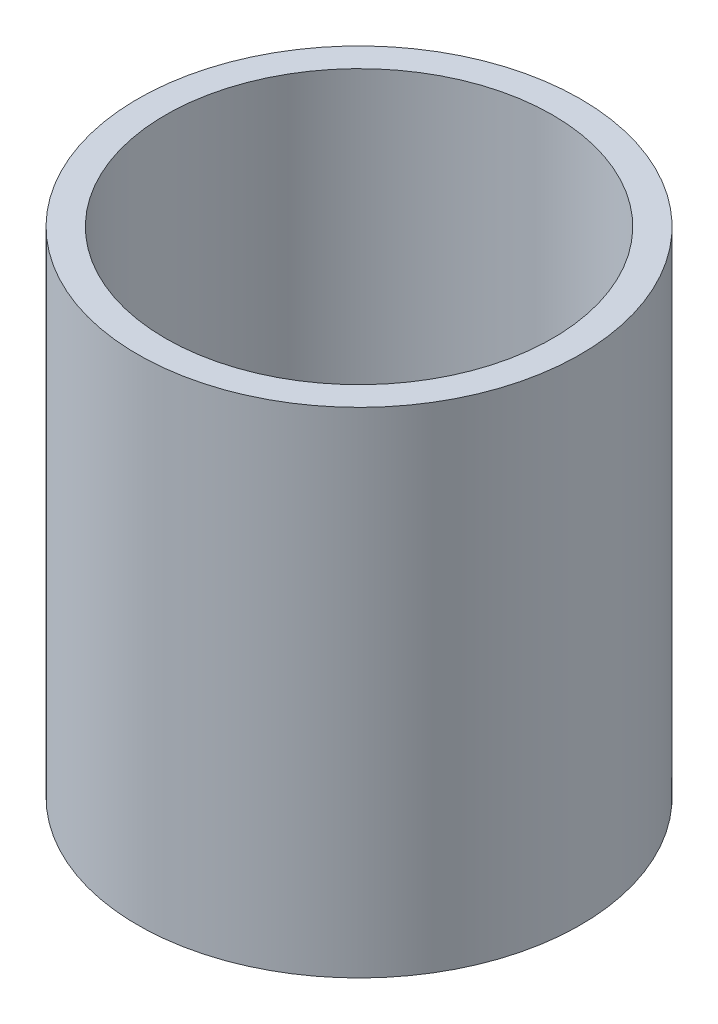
ISO-10303-21;
HEADER;
FILE_DESCRIPTION(('STEP AP214'),'2;1');
FILE_NAME('part.step','',(''),(''),'','','');
FILE_SCHEMA(('AUTOMOTIVE_DESIGN { 1 0 10303 214 1 1 1 1 }'));
ENDSEC;
DATA;
#1=APPLICATION_CONTEXT('core data for automotive mechanical design processes');
#2=APPLICATION_PROTOCOL_DEFINITION('international standard','automotive_design',2000,#1);
#3=PRODUCT_CONTEXT('',#1,'mechanical');
#4=PRODUCT('Part','Part','',(#3));
#5=PRODUCT_RELATED_PRODUCT_CATEGORY('part','',(#4));
#6=PRODUCT_DEFINITION_FORMATION('','',#4);
#7=PRODUCT_DEFINITION_CONTEXT('part definition',#1,'design');
#8=PRODUCT_DEFINITION('design','',#6,#7);
#9=PRODUCT_DEFINITION_SHAPE('','',#8);
#10=(LENGTH_UNIT() NAMED_UNIT(*) SI_UNIT(.MILLI.,.METRE.));
#11=(NAMED_UNIT(*) PLANE_ANGLE_UNIT() SI_UNIT($,.RADIAN.));
#12=(NAMED_UNIT(*) SI_UNIT($,.STERADIAN.) SOLID_ANGLE_UNIT());
#13=UNCERTAINTY_MEASURE_WITH_UNIT(LENGTH_MEASURE(1.E-05),#10,'distance_accuracy_value','');
#14=(GEOMETRIC_REPRESENTATION_CONTEXT(3) GLOBAL_UNCERTAINTY_ASSIGNED_CONTEXT((#13)) GLOBAL_UNIT_ASSIGNED_CONTEXT((#10,
#11,#12)) REPRESENTATION_CONTEXT('',''));
#15=CARTESIAN_POINT('',(0.,0.,0.));
#16=DIRECTION('',(0.,0.,1.));
#17=DIRECTION('',(1.,0.,0.));
#18=AXIS2_PLACEMENT_3D('',#15,#16,#17);
#19=CARTESIAN_POINT('',(0.,304.8,0.));
#20=DIRECTION('',(0.,1.,0.));
#21=DIRECTION('',(0.,0.,1.));
#22=AXIS2_PLACEMENT_3D('',#19,#20,#21);
#23=PLANE('',#22);
#24=CARTESIAN_POINT('',(0.,304.8,0.));
#25=DIRECTION('',(0.,1.,0.));
#26=DIRECTION('',(0.,0.,1.));
#27=AXIS2_PLACEMENT_3D('',#24,#25,#26);
#28=CIRCLE('',#27,136.525);
#29=CARTESIAN_POINT('',(0.,304.8,-136.525));
#30=VERTEX_POINT('',#29);
#31=EDGE_CURVE('E10',#30,#30,#28,.T.);
#32=ORIENTED_EDGE('',*,*,#31,.T.);
#33=EDGE_LOOP('',(#32));
#34=FACE_BOUND('',#33,.T.);
#35=CARTESIAN_POINT('',(0.,304.8,0.));
#36=DIRECTION('',(0.,1.,0.));
#37=DIRECTION('',(0.,0.,1.));
#38=AXIS2_PLACEMENT_3D('',#35,#36,#37);
#39=CIRCLE('',#38,119.38);
#40=CARTESIAN_POINT('',(0.,304.8,-119.38));
#41=VERTEX_POINT('',#40);
#42=EDGE_CURVE('E42',#41,#41,#39,.T.);
#43=ORIENTED_EDGE('',*,*,#42,.F.);
#44=EDGE_LOOP('',(#43));
#45=FACE_BOUND('',#44,.T.);
#46=ADVANCED_FACE('F31',(#34,#45),#23,.T.);
#47=CARTESIAN_POINT('',(0.,0.,0.));
#48=DIRECTION('',(0.,1.,0.));
#49=DIRECTION('',(0.,0.,1.));
#50=AXIS2_PLACEMENT_3D('',#47,#48,#49);
#51=PLANE('',#50);
#52=CARTESIAN_POINT('',(0.,0.,0.));
#53=DIRECTION('',(0.,1.,0.));
#54=DIRECTION('',(0.,0.,1.));
#55=AXIS2_PLACEMENT_3D('',#52,#53,#54);
#56=CIRCLE('',#55,136.525);
#57=CARTESIAN_POINT('',(0.,0.,-136.525));
#58=VERTEX_POINT('',#57);
#59=EDGE_CURVE('E35',#58,#58,#56,.T.);
#60=ORIENTED_EDGE('',*,*,#59,.F.);
#61=EDGE_LOOP('',(#60));
#62=FACE_BOUND('',#61,.T.);
#63=CARTESIAN_POINT('',(0.,0.,0.));
#64=DIRECTION('',(0.,1.,0.));
#65=DIRECTION('',(0.,0.,1.));
#66=AXIS2_PLACEMENT_3D('',#63,#64,#65);
#67=CIRCLE('',#66,119.38);
#68=CARTESIAN_POINT('',(0.,0.,-119.38));
#69=VERTEX_POINT('',#68);
#70=EDGE_CURVE('E44',#69,#69,#67,.T.);
#71=ORIENTED_EDGE('',*,*,#70,.T.);
#72=EDGE_LOOP('',(#71));
#73=FACE_BOUND('',#72,.T.);
#74=ADVANCED_FACE('F54',(#62,#73),#51,.F.);
#75=CARTESIAN_POINT('',(0.,304.8,0.));
#76=DIRECTION('',(0.,-1.,0.));
#77=DIRECTION('',(0.,0.,-1.));
#78=AXIS2_PLACEMENT_3D('',#75,#76,#77);
#79=CYLINDRICAL_SURFACE('',#78,136.525);
#80=CARTESIAN_POINT('',(0.,304.8,-136.525));
#81=CARTESIAN_POINT('',(0.,301.625,-136.525));
#82=CARTESIAN_POINT('',(0.,298.45,-136.525));
#83=CARTESIAN_POINT('',(0.,292.1,-136.525));
#84=CARTESIAN_POINT('',(0.,288.925,-136.525));
#85=CARTESIAN_POINT('',(0.,282.575,-136.525));
#86=CARTESIAN_POINT('',(0.,279.4,-136.525));
#87=CARTESIAN_POINT('',(0.,273.05,-136.525));
#88=CARTESIAN_POINT('',(0.,269.875,-136.525));
#89=CARTESIAN_POINT('',(0.,263.525,-136.525));
#90=CARTESIAN_POINT('',(0.,260.35,-136.525));
#91=CARTESIAN_POINT('',(0.,254.,-136.525));
#92=CARTESIAN_POINT('',(0.,250.825,-136.525));
#93=CARTESIAN_POINT('',(0.,244.475,-136.525));
#94=CARTESIAN_POINT('',(0.,241.3,-136.525));
#95=CARTESIAN_POINT('',(0.,234.95,-136.525));
#96=CARTESIAN_POINT('',(0.,231.775,-136.525));
#97=CARTESIAN_POINT('',(0.,225.425,-136.525));
#98=CARTESIAN_POINT('',(0.,222.25,-136.525));
#99=CARTESIAN_POINT('',(0.,215.9,-136.525));
#100=CARTESIAN_POINT('',(0.,212.725,-136.525));
#101=CARTESIAN_POINT('',(0.,206.375,-136.525));
#102=CARTESIAN_POINT('',(0.,203.2,-136.525));
#103=CARTESIAN_POINT('',(0.,196.85,-136.525));
#104=CARTESIAN_POINT('',(0.,193.675,-136.525));
#105=CARTESIAN_POINT('',(0.,187.325,-136.525));
#106=CARTESIAN_POINT('',(0.,184.15,-136.525));
#107=CARTESIAN_POINT('',(0.,177.8,-136.525));
#108=CARTESIAN_POINT('',(0.,174.625,-136.525));
#109=CARTESIAN_POINT('',(0.,168.275,-136.525));
#110=CARTESIAN_POINT('',(0.,165.1,-136.525));
#111=CARTESIAN_POINT('',(0.,158.75,-136.525));
#112=CARTESIAN_POINT('',(0.,155.575,-136.525));
#113=CARTESIAN_POINT('',(0.,149.225,-136.525));
#114=CARTESIAN_POINT('',(0.,146.05,-136.525));
#115=CARTESIAN_POINT('',(0.,139.7,-136.525));
#116=CARTESIAN_POINT('',(0.,136.525,-136.525));
#117=CARTESIAN_POINT('',(0.,130.175,-136.525));
#118=CARTESIAN_POINT('',(0.,127.,-136.525));
#119=CARTESIAN_POINT('',(0.,120.65,-136.525));
#120=CARTESIAN_POINT('',(0.,117.475,-136.525));
#121=CARTESIAN_POINT('',(0.,111.125,-136.525));
#122=CARTESIAN_POINT('',(0.,107.95,-136.525));
#123=CARTESIAN_POINT('',(0.,101.6,-136.525));
#124=CARTESIAN_POINT('',(0.,98.425,-136.525));
#125=CARTESIAN_POINT('',(0.,92.075,-136.525));
#126=CARTESIAN_POINT('',(0.,88.9,-136.525));
#127=CARTESIAN_POINT('',(0.,82.55,-136.525));
#128=CARTESIAN_POINT('',(0.,79.375,-136.525));
#129=CARTESIAN_POINT('',(0.,73.025,-136.525));
#130=CARTESIAN_POINT('',(0.,69.85,-136.525));
#131=CARTESIAN_POINT('',(0.,63.5,-136.525));
#132=CARTESIAN_POINT('',(0.,60.325,-136.525));
#133=CARTESIAN_POINT('',(0.,53.975,-136.525));
#134=CARTESIAN_POINT('',(0.,50.8,-136.525));
#135=CARTESIAN_POINT('',(0.,44.45,-136.525));
#136=CARTESIAN_POINT('',(0.,41.275,-136.525));
#137=CARTESIAN_POINT('',(0.,34.925,-136.525));
#138=CARTESIAN_POINT('',(0.,31.75,-136.525));
#139=CARTESIAN_POINT('',(0.,25.4,-136.525));
#140=CARTESIAN_POINT('',(0.,22.225,-136.525));
#141=CARTESIAN_POINT('',(0.,15.875,-136.525));
#142=CARTESIAN_POINT('',(0.,12.7,-136.525));
#143=CARTESIAN_POINT('',(0.,6.35,-136.525));
#144=CARTESIAN_POINT('',(0.,3.175,-136.525));
#145=CARTESIAN_POINT('',(0.,0.,-136.525));
#146=B_SPLINE_CURVE_WITH_KNOTS('',3,(#80,#81,#82,#83,#84,#85,#86,#87,#88,#89,#90,#91,#92,#93,
#94,#95,#96,#97,#98,#99,#100,#101,#102,#103,#104,#105,#106,#107,#108,#109,#110,#111,#112,#113,
#114,#115,#116,#117,#118,#119,#120,#121,#122,#123,#124,#125,#126,#127,#128,#129,#130,#131,#132,
#133,#134,#135,#136,#137,#138,#139,#140,#141,#142,#143,#144,#145),.UNSPECIFIED.,.F.,.F.,(4,2,2,
2,2,2,2,2,2,2,2,2,2,2,2,2,2,2,2,2,2,2,2,2,2,2,2,2,2,2,2,2,4),(0.,9.52499999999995,19.05,28.575,
38.1,47.625,57.15,66.675,76.2,85.725,95.2499999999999,104.775,114.3,123.825,133.35,142.875,
152.4,161.925,171.45,180.975,190.5,200.025,209.55,219.075,228.6,238.125,247.65,257.175,266.7,
276.225,285.75,295.275,304.8),.UNSPECIFIED.);
#147=EDGE_CURVE('BSEAM33',#30,#58,#146,.T.);
#148=ORIENTED_EDGE('',*,*,#31,.F.);
#149=ORIENTED_EDGE('',*,*,#59,.T.);
#150=ORIENTED_EDGE('',*,*,#147,.T.);
#151=ORIENTED_EDGE('',*,*,#147,.F.);
#152=EDGE_LOOP('',(#148,#150,#149,#151));
#153=FACE_BOUND('',#152,.T.);
#154=ADVANCED_FACE('F33',(#153),#79,.T.);
#155=CARTESIAN_POINT('',(0.,304.8,0.));
#156=DIRECTION('',(0.,-1.,0.));
#157=DIRECTION('',(0.,0.,-1.));
#158=AXIS2_PLACEMENT_3D('',#155,#156,#157);
#159=CYLINDRICAL_SURFACE('',#158,119.38);
#160=CARTESIAN_POINT('',(0.,304.8,-119.38));
#161=CARTESIAN_POINT('',(0.,301.625,-119.38));
#162=CARTESIAN_POINT('',(0.,298.45,-119.38));
#163=CARTESIAN_POINT('',(0.,292.1,-119.38));
#164=CARTESIAN_POINT('',(0.,288.925,-119.38));
#165=CARTESIAN_POINT('',(0.,282.575,-119.38));
#166=CARTESIAN_POINT('',(0.,279.4,-119.38));
#167=CARTESIAN_POINT('',(0.,273.05,-119.38));
#168=CARTESIAN_POINT('',(0.,269.875,-119.38));
#169=CARTESIAN_POINT('',(0.,263.525,-119.38));
#170=CARTESIAN_POINT('',(0.,260.35,-119.38));
#171=CARTESIAN_POINT('',(0.,254.,-119.38));
#172=CARTESIAN_POINT('',(0.,250.825,-119.38));
#173=CARTESIAN_POINT('',(0.,244.475,-119.38));
#174=CARTESIAN_POINT('',(0.,241.3,-119.38));
#175=CARTESIAN_POINT('',(0.,234.95,-119.38));
#176=CARTESIAN_POINT('',(0.,231.775,-119.38));
#177=CARTESIAN_POINT('',(0.,225.425,-119.38));
#178=CARTESIAN_POINT('',(0.,222.25,-119.38));
#179=CARTESIAN_POINT('',(0.,215.9,-119.38));
#180=CARTESIAN_POINT('',(0.,212.725,-119.38));
#181=CARTESIAN_POINT('',(0.,206.375,-119.38));
#182=CARTESIAN_POINT('',(0.,203.2,-119.38));
#183=CARTESIAN_POINT('',(0.,196.85,-119.38));
#184=CARTESIAN_POINT('',(0.,193.675,-119.38));
#185=CARTESIAN_POINT('',(0.,187.325,-119.38));
#186=CARTESIAN_POINT('',(0.,184.15,-119.38));
#187=CARTESIAN_POINT('',(0.,177.8,-119.38));
#188=CARTESIAN_POINT('',(0.,174.625,-119.38));
#189=CARTESIAN_POINT('',(0.,168.275,-119.38));
#190=CARTESIAN_POINT('',(0.,165.1,-119.38));
#191=CARTESIAN_POINT('',(0.,158.75,-119.38));
#192=CARTESIAN_POINT('',(0.,155.575,-119.38));
#193=CARTESIAN_POINT('',(0.,149.225,-119.38));
#194=CARTESIAN_POINT('',(0.,146.05,-119.38));
#195=CARTESIAN_POINT('',(0.,139.7,-119.38));
#196=CARTESIAN_POINT('',(0.,136.525,-119.38));
#197=CARTESIAN_POINT('',(0.,130.175,-119.38));
#198=CARTESIAN_POINT('',(0.,127.,-119.38));
#199=CARTESIAN_POINT('',(0.,120.65,-119.38));
#200=CARTESIAN_POINT('',(0.,117.475,-119.38));
#201=CARTESIAN_POINT('',(0.,111.125,-119.38));
#202=CARTESIAN_POINT('',(0.,107.95,-119.38));
#203=CARTESIAN_POINT('',(0.,101.6,-119.38));
#204=CARTESIAN_POINT('',(0.,98.425,-119.38));
#205=CARTESIAN_POINT('',(0.,92.075,-119.38));
#206=CARTESIAN_POINT('',(0.,88.9,-119.38));
#207=CARTESIAN_POINT('',(0.,82.55,-119.38));
#208=CARTESIAN_POINT('',(0.,79.375,-119.38));
#209=CARTESIAN_POINT('',(0.,73.025,-119.38));
#210=CARTESIAN_POINT('',(0.,69.85,-119.38));
#211=CARTESIAN_POINT('',(0.,63.5,-119.38));
#212=CARTESIAN_POINT('',(0.,60.325,-119.38));
#213=CARTESIAN_POINT('',(0.,53.975,-119.38));
#214=CARTESIAN_POINT('',(0.,50.8,-119.38));
#215=CARTESIAN_POINT('',(0.,44.45,-119.38));
#216=CARTESIAN_POINT('',(0.,41.275,-119.38));
#217=CARTESIAN_POINT('',(0.,34.925,-119.38));
#218=CARTESIAN_POINT('',(0.,31.75,-119.38));
#219=CARTESIAN_POINT('',(0.,25.4,-119.38));
#220=CARTESIAN_POINT('',(0.,22.225,-119.38));
#221=CARTESIAN_POINT('',(0.,15.875,-119.38));
#222=CARTESIAN_POINT('',(0.,12.7,-119.38));
#223=CARTESIAN_POINT('',(0.,6.35,-119.38));
#224=CARTESIAN_POINT('',(0.,3.175,-119.38));
#225=CARTESIAN_POINT('',(0.,0.,-119.38));
#226=B_SPLINE_CURVE_WITH_KNOTS('',3,(#160,#161,#162,#163,#164,#165,#166,#167,#168,#169,#170,
#171,#172,#173,#174,#175,#176,#177,#178,#179,#180,#181,#182,#183,#184,#185,#186,#187,#188,#189,
#190,#191,#192,#193,#194,#195,#196,#197,#198,#199,#200,#201,#202,#203,#204,#205,#206,#207,#208,
#209,#210,#211,#212,#213,#214,#215,#216,#217,#218,#219,#220,#221,#222,#223,#224,#225),
.UNSPECIFIED.,.F.,.F.,(4,2,2,2,2,2,2,2,2,2,2,2,2,2,2,2,2,2,2,2,2,2,2,2,2,2,2,2,2,2,2,2,4),(0.,
9.52499999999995,19.05,28.575,38.1,47.625,57.15,66.675,76.2,85.725,95.2499999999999,104.775,
114.3,123.825,133.35,142.875,152.4,161.925,171.45,180.975,190.5,200.025,209.55,219.075,228.6,
238.125,247.65,257.175,266.7,276.225,285.75,295.275,304.8),.UNSPECIFIED.);
#227=EDGE_CURVE('BSEAM50',#41,#69,#226,.T.);
#228=ORIENTED_EDGE('',*,*,#42,.T.);
#229=ORIENTED_EDGE('',*,*,#70,.F.);
#230=ORIENTED_EDGE('',*,*,#227,.T.);
#231=ORIENTED_EDGE('',*,*,#227,.F.);
#232=EDGE_LOOP('',(#228,#230,#229,#231));
#233=FACE_BOUND('',#232,.T.);
#234=ADVANCED_FACE('F50',(#233),#159,.F.);
#235=CLOSED_SHELL('',(#46,#74,#154,#234));
#236=MANIFOLD_SOLID_BREP('B2',#235);
#237=ADVANCED_BREP_SHAPE_REPRESENTATION('',(#18,#236),#14);
#238=SHAPE_DEFINITION_REPRESENTATION(#9,#237);
ENDSEC;
END-ISO-10303-21;
